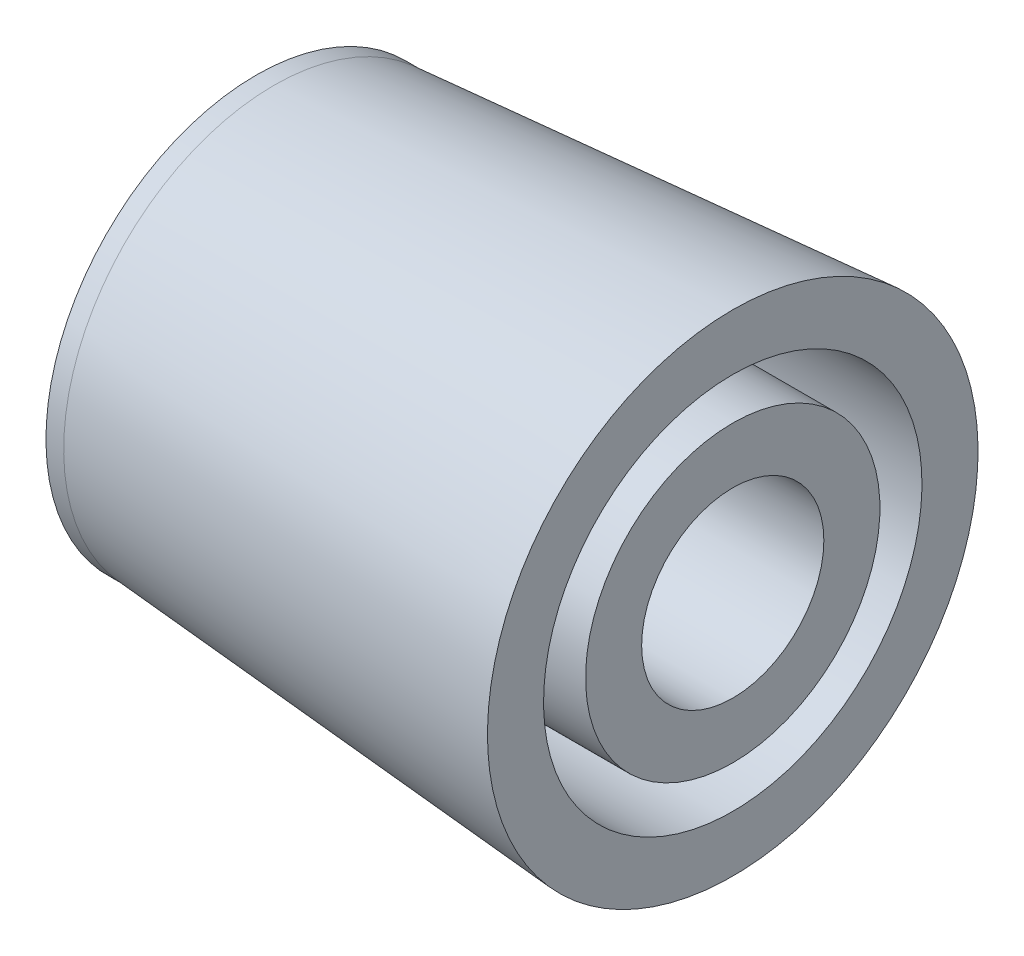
from build123d import *


with BuildPart() as part:
    # Skica1 → Rotovat1 (revolve)
    with BuildSketch(Plane.XY):
        Polygon((24.613675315, -1.622787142), (24.613675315, 5.877212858), (25.24628937, 5.877212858), (41.613675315, 7.127212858), (41.613675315, 5.127212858), (31.613675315, 5.127212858), (31.613675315, 3.627212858), (41.613675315, 3.627212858), (41.613675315, 1.627212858), (26.613675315, 1.627212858), (26.613675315, -1.622787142), align=None)
    revolve(axis=Axis((26.613675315, -1.622787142, 0), (-1, 0, 0)))


solid = part.part
